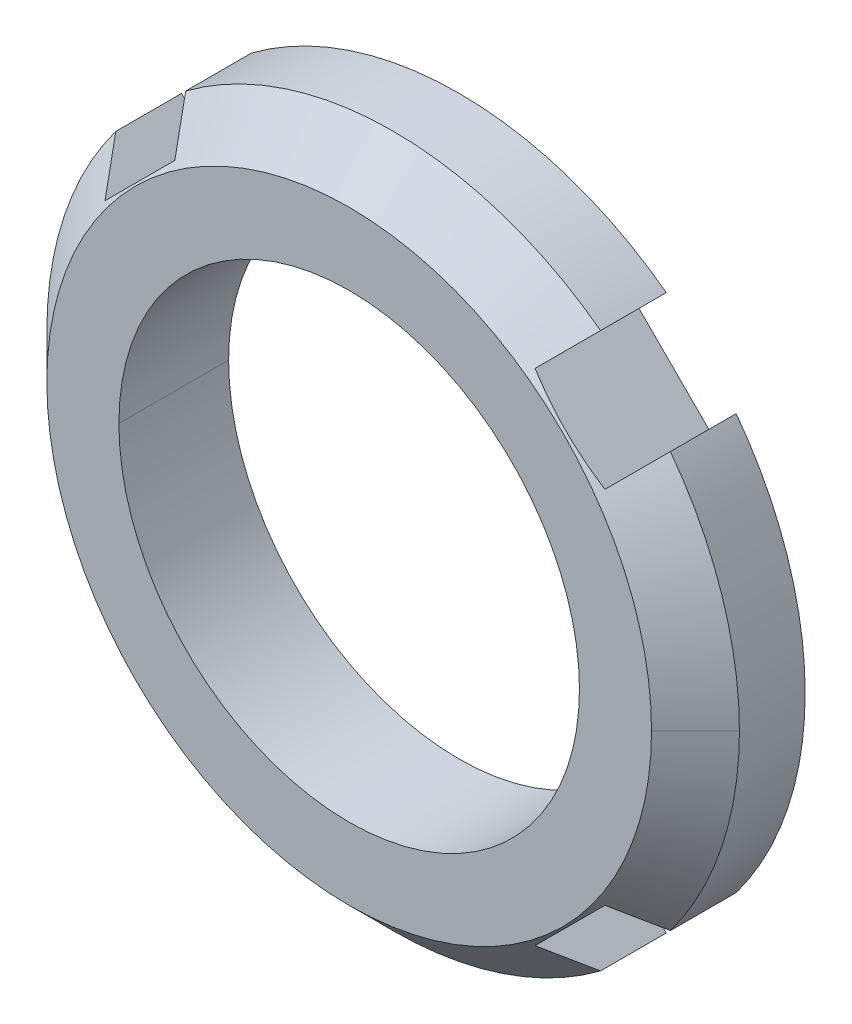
ISO-10303-21;
HEADER;
FILE_DESCRIPTION(('STEP AP214'),'2;1');
FILE_NAME('part.step','',(''),(''),'','','');
FILE_SCHEMA(('AUTOMOTIVE_DESIGN { 1 0 10303 214 1 1 1 1 }'));
ENDSEC;
DATA;
#1=APPLICATION_CONTEXT('core data for automotive mechanical design processes');
#2=APPLICATION_PROTOCOL_DEFINITION('international standard','automotive_design',2000,#1);
#3=PRODUCT_CONTEXT('',#1,'mechanical');
#4=PRODUCT('Part','Part','',(#3));
#5=PRODUCT_RELATED_PRODUCT_CATEGORY('part','',(#4));
#6=PRODUCT_DEFINITION_FORMATION('','',#4);
#7=PRODUCT_DEFINITION_CONTEXT('part definition',#1,'design');
#8=PRODUCT_DEFINITION('design','',#6,#7);
#9=PRODUCT_DEFINITION_SHAPE('','',#8);
#10=(LENGTH_UNIT() NAMED_UNIT(*) SI_UNIT(.MILLI.,.METRE.));
#11=(NAMED_UNIT(*) PLANE_ANGLE_UNIT() SI_UNIT($,.RADIAN.));
#12=(NAMED_UNIT(*) SI_UNIT($,.STERADIAN.) SOLID_ANGLE_UNIT());
#13=UNCERTAINTY_MEASURE_WITH_UNIT(LENGTH_MEASURE(1.E-05),#10,'distance_accuracy_value','');
#14=(GEOMETRIC_REPRESENTATION_CONTEXT(3) GLOBAL_UNCERTAINTY_ASSIGNED_CONTEXT((#13)) GLOBAL_UNIT_ASSIGNED_CONTEXT((#10,
#11,#12)) REPRESENTATION_CONTEXT('',''));
#15=CARTESIAN_POINT('',(0.,0.,0.));
#16=DIRECTION('',(0.,0.,1.));
#17=DIRECTION('',(1.,0.,0.));
#18=AXIS2_PLACEMENT_3D('',#15,#16,#17);
#19=CARTESIAN_POINT('',(0.,0.,4.74979999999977));
#20=DIRECTION('',(0.,0.,-1.));
#21=DIRECTION('',(-1.,0.,0.));
#22=AXIS2_PLACEMENT_3D('',#19,#20,#21);
#23=CONICAL_SURFACE('',#22,25.0189999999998,0.7853981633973);
#24=CARTESIAN_POINT('',(0.,0.,4.7498));
#25=DIRECTION('',(0.,0.,1.));
#26=DIRECTION('',(1.,0.,0.));
#27=AXIS2_PLACEMENT_3D('',#24,#25,#26);
#28=CIRCLE('',#27,25.019);
#29=CARTESIAN_POINT('',(-20.0336595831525,-14.9867556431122,4.7497999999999));
#30=VERTEX_POINT('',#29);
#31=CARTESIAN_POINT('',(-25.0189999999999,0.,4.74979999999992));
#32=VERTEX_POINT('',#31);
#33=EDGE_CURVE('E379',#30,#32,#28,.F.);
#34=ORIENTED_EDGE('',*,*,#33,.F.);
#35=CARTESIAN_POINT('',(-18.0592950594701,-13.0123911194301,7.50985885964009));
#36=CARTESIAN_POINT('',(-18.3885780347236,-13.3416740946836,7.05016696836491));
#37=CARTESIAN_POINT('',(-18.7177499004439,-13.6708459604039,6.59031611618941));
#38=CARTESIAN_POINT('',(-19.3758714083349,-14.3289674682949,5.67029649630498));
#39=CARTESIAN_POINT('',(-19.7048210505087,-14.6579171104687,5.21012772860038));
#40=CARTESIAN_POINT('',(-20.0336595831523,-14.9867556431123,4.7497999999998));
#41=B_SPLINE_CURVE_WITH_KNOTS('',3,(#35,#36,#37,#38,#39,#40),.UNSPECIFIED.,.F.,.F.,(4,2,4),(0.,
1.96304339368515,3.92608676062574),.UNSPECIFIED.);
#42=CARTESIAN_POINT('',(-18.05929505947,-13.01239111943,7.50985885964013));
#43=VERTEX_POINT('',#42);
#44=EDGE_CURVE('E151',#43,#30,#41,.T.);
#45=ORIENTED_EDGE('',*,*,#44,.F.);
#46=CARTESIAN_POINT('',(-13.01239111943,-18.05929505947,7.50985885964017));
#47=CARTESIAN_POINT('',(-13.2215777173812,-17.8501084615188,7.55730968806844));
#48=CARTESIAN_POINT('',(-13.431413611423,-17.640272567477,7.59912125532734));
#49=CARTESIAN_POINT('',(-13.8520969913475,-17.2195891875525,7.67111026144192));
#50=CARTESIAN_POINT('',(-14.062944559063,-17.008741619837,7.70128674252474));
#51=CARTESIAN_POINT('',(-14.4839687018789,-16.5877174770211,7.74948622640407));
#52=CARTESIAN_POINT('',(-14.6941408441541,-16.3775453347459,7.76758630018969));
#53=CARTESIAN_POINT('',(-15.1148230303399,-15.9568631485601,7.79174293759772));
#54=CARTESIAN_POINT('',(-15.325333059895,-15.746353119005,7.79779999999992));
#55=CARTESIAN_POINT('',(-15.746353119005,-15.325333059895,7.79779999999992));
#56=CARTESIAN_POINT('',(-15.9568631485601,-15.1148230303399,7.79174293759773));
#57=CARTESIAN_POINT('',(-16.3775453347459,-14.6941408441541,7.76758630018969));
#58=CARTESIAN_POINT('',(-16.5877174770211,-14.4839687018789,7.74948622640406));
#59=CARTESIAN_POINT('',(-17.008741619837,-14.062944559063,7.70128674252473));
#60=CARTESIAN_POINT('',(-17.2195891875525,-13.8520969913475,7.67111026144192));
#61=CARTESIAN_POINT('',(-17.640272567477,-13.431413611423,7.59912125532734));
#62=CARTESIAN_POINT('',(-17.8501084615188,-13.2215777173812,7.55730968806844));
#63=CARTESIAN_POINT('',(-18.05929505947,-13.01239111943,7.50985885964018));
#64=B_SPLINE_CURVE_WITH_KNOTS('',3,(#46,#47,#48,#49,#50,#51,#52,#53,#54,#55,#56,#57,#58,#59,#60,
#61,#62,#63),.UNSPECIFIED.,.F.,.F.,(4,2,2,2,2,2,2,2,4),(0.,0.898813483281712,1.79770093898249,
2.69079542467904,3.58385292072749,4.47691041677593,5.37000490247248,6.26889235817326,
7.16770584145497),.UNSPECIFIED.);
#65=CARTESIAN_POINT('',(-13.01239111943,-18.05929505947,7.50985885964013));
#66=VERTEX_POINT('',#65);
#67=EDGE_CURVE('E152',#66,#43,#64,.T.);
#68=ORIENTED_EDGE('',*,*,#67,.F.);
#69=CARTESIAN_POINT('',(-14.9867556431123,-20.0336595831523,4.7497999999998));
#70=CARTESIAN_POINT('',(-14.6579171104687,-19.7048210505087,5.21012772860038));
#71=CARTESIAN_POINT('',(-14.3289674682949,-19.3758714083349,5.67029649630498));
#72=CARTESIAN_POINT('',(-13.6708459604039,-18.7177499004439,6.59031611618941));
#73=CARTESIAN_POINT('',(-13.3416740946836,-18.3885780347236,7.05016696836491));
#74=CARTESIAN_POINT('',(-13.0123911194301,-18.0592950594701,7.50985885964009));
#75=B_SPLINE_CURVE_WITH_KNOTS('',3,(#69,#70,#71,#72,#73,#74),.UNSPECIFIED.,.F.,.F.,(4,2,4),(0.,
1.96304336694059,3.92608676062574),.UNSPECIFIED.);
#76=CARTESIAN_POINT('',(-14.9867556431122,-20.0336595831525,4.7497999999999));
#77=VERTEX_POINT('',#76);
#78=EDGE_CURVE('E267',#77,#66,#75,.T.);
#79=ORIENTED_EDGE('',*,*,#78,.F.);
#80=CARTESIAN_POINT('',(0.,0.,4.7498));
#81=DIRECTION('',(0.,0.,1.));
#82=DIRECTION('',(1.,0.,0.));
#83=AXIS2_PLACEMENT_3D('',#80,#81,#82);
#84=CIRCLE('',#83,25.019);
#85=CARTESIAN_POINT('',(14.9867556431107,-20.0336595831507,4.74980000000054));
#86=VERTEX_POINT('',#85);
#87=EDGE_CURVE('E368',#86,#77,#84,.F.);
#88=ORIENTED_EDGE('',*,*,#87,.F.);
#89=CARTESIAN_POINT('',(13.0123911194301,-18.0592950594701,7.50985885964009));
#90=CARTESIAN_POINT('',(13.3416740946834,-18.3885780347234,7.05016696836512));
#91=CARTESIAN_POINT('',(13.6708459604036,-18.7177499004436,6.59031611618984));
#92=CARTESIAN_POINT('',(14.3289674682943,-19.3758714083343,5.67029649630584));
#93=CARTESIAN_POINT('',(14.6579171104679,-19.7048210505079,5.21012772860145));
#94=CARTESIAN_POINT('',(14.9867556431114,-20.0336595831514,4.74980000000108));
#95=B_SPLINE_CURVE_WITH_KNOTS('',3,(#89,#90,#91,#92,#93,#94),.UNSPECIFIED.,.F.,.F.,(4,2,4),(0.,
1.96304339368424,3.92608676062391),.UNSPECIFIED.);
#96=CARTESIAN_POINT('',(13.01239111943,-18.05929505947,7.50985885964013));
#97=VERTEX_POINT('',#96);
#98=EDGE_CURVE('E262',#97,#86,#95,.T.);
#99=ORIENTED_EDGE('',*,*,#98,.F.);
#100=CARTESIAN_POINT('',(18.05929505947,-13.01239111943,7.50985885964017));
#101=CARTESIAN_POINT('',(17.8501084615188,-13.2215777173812,7.55730968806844));
#102=CARTESIAN_POINT('',(17.640272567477,-13.431413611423,7.59912125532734));
#103=CARTESIAN_POINT('',(17.2195891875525,-13.8520969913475,7.67111026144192));
#104=CARTESIAN_POINT('',(17.008741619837,-14.062944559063,7.70128674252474));
#105=CARTESIAN_POINT('',(16.5877174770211,-14.4839687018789,7.74948622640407));
#106=CARTESIAN_POINT('',(16.3775453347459,-14.6941408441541,7.76758630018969));
#107=CARTESIAN_POINT('',(15.9568631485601,-15.1148230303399,7.79174293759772));
#108=CARTESIAN_POINT('',(15.746353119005,-15.325333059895,7.79779999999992));
#109=CARTESIAN_POINT('',(15.325333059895,-15.746353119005,7.79779999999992));
#110=CARTESIAN_POINT('',(15.1148230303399,-15.9568631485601,7.79174293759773));
#111=CARTESIAN_POINT('',(14.6941408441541,-16.3775453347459,7.76758630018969));
#112=CARTESIAN_POINT('',(14.4839687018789,-16.5877174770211,7.74948622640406));
#113=CARTESIAN_POINT('',(14.062944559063,-17.008741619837,7.70128674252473));
#114=CARTESIAN_POINT('',(13.8520969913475,-17.2195891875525,7.67111026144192));
#115=CARTESIAN_POINT('',(13.431413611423,-17.640272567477,7.59912125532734));
#116=CARTESIAN_POINT('',(13.2215777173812,-17.8501084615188,7.55730968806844));
#117=CARTESIAN_POINT('',(13.01239111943,-18.05929505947,7.50985885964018));
#118=B_SPLINE_CURVE_WITH_KNOTS('',3,(#100,#101,#102,#103,#104,#105,#106,#107,#108,#109,#110,
#111,#112,#113,#114,#115,#116,#117),.UNSPECIFIED.,.F.,.F.,(4,2,2,2,2,2,2,2,4),(0.,
0.898813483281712,1.79770093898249,2.69079542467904,3.58385292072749,4.47691041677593,
5.37000490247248,6.26889235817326,7.16770584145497),.UNSPECIFIED.);
#119=CARTESIAN_POINT('',(18.05929505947,-13.01239111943,7.50985885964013));
#120=VERTEX_POINT('',#119);
#121=EDGE_CURVE('E256',#120,#97,#118,.T.);
#122=ORIENTED_EDGE('',*,*,#121,.F.);
#123=CARTESIAN_POINT('',(20.0336595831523,-14.9867556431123,4.7497999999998));
#124=CARTESIAN_POINT('',(19.7048210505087,-14.6579171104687,5.21012772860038));
#125=CARTESIAN_POINT('',(19.3758714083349,-14.3289674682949,5.67029649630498));
#126=CARTESIAN_POINT('',(18.7177499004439,-13.6708459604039,6.59031611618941));
#127=CARTESIAN_POINT('',(18.3885780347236,-13.3416740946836,7.05016696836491));
#128=CARTESIAN_POINT('',(18.0592950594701,-13.0123911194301,7.50985885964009));
#129=B_SPLINE_CURVE_WITH_KNOTS('',3,(#123,#124,#125,#126,#127,#128),.UNSPECIFIED.,.F.,.F.,(4,2,
4),(0.,1.96304336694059,3.92608676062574),.UNSPECIFIED.);
#130=CARTESIAN_POINT('',(20.0336595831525,-14.9867556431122,4.7497999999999));
#131=VERTEX_POINT('',#130);
#132=EDGE_CURVE('E249',#131,#120,#129,.T.);
#133=ORIENTED_EDGE('',*,*,#132,.F.);
#134=CARTESIAN_POINT('',(0.,0.,4.7498));
#135=DIRECTION('',(0.,0.,1.));
#136=DIRECTION('',(1.,0.,0.));
#137=AXIS2_PLACEMENT_3D('',#134,#135,#136);
#138=CIRCLE('',#137,25.019);
#139=CARTESIAN_POINT('',(25.0189999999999,0.,4.74979999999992));
#140=VERTEX_POINT('',#139);
#141=EDGE_CURVE('E147',#140,#131,#138,.F.);
#142=ORIENTED_EDGE('',*,*,#141,.F.);
#143=DIRECTION('',(-0.707106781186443,0.,0.707106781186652));
#144=VECTOR('',#143,1.);
#145=CARTESIAN_POINT('',(23.4315,0.,6.3373));
#146=LINE('',#145,#144);
#147=CARTESIAN_POINT('',(21.8440000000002,0.,7.92480000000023));
#148=VERTEX_POINT('',#147);
#149=EDGE_CURVE('E142',#148,#140,#146,.F.);
#150=ORIENTED_EDGE('',*,*,#149,.F.);
#151=CARTESIAN_POINT('',(0.,0.,7.92480000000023));
#152=DIRECTION('',(0.,0.,-1.));
#153=DIRECTION('',(-1.,0.,0.));
#154=AXIS2_PLACEMENT_3D('',#151,#152,#153);
#155=CIRCLE('',#154,21.8440000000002);
#156=CARTESIAN_POINT('',(-21.8440000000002,0.,7.92480000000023));
#157=VERTEX_POINT('',#156);
#158=EDGE_CURVE('E20',#157,#148,#155,.F.);
#159=ORIENTED_EDGE('',*,*,#158,.F.);
#160=DIRECTION('',(0.707106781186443,0.,0.707106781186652));
#161=VECTOR('',#160,1.);
#162=CARTESIAN_POINT('',(-23.4315,0.,6.3373));
#163=LINE('',#162,#161);
#164=EDGE_CURVE('E133',#32,#157,#163,.T.);
#165=ORIENTED_EDGE('',*,*,#164,.F.);
#166=EDGE_LOOP('',(#34,#45,#68,#79,#88,#99,#122,#133,#142,#150,#159,#165));
#167=FACE_BOUND('',#166,.T.);
#168=ADVANCED_FACE('F16',(#167),#23,.T.);
#169=CARTESIAN_POINT('',(0.,0.,4.74979999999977));
#170=DIRECTION('',(0.,0.,-1.));
#171=DIRECTION('',(-1.,0.,0.));
#172=AXIS2_PLACEMENT_3D('',#169,#170,#171);
#173=CONICAL_SURFACE('',#172,25.0189999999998,0.7853981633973);
#174=CARTESIAN_POINT('',(-13.01239111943,18.05929505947,7.50985885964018));
#175=CARTESIAN_POINT('',(-13.2215777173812,17.8501084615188,7.55730968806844));
#176=CARTESIAN_POINT('',(-13.431413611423,17.640272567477,7.59912125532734));
#177=CARTESIAN_POINT('',(-13.8520969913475,17.2195891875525,7.67111026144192));
#178=CARTESIAN_POINT('',(-14.062944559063,17.008741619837,7.70128674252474));
#179=CARTESIAN_POINT('',(-14.4839687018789,16.5877174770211,7.74948622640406));
#180=CARTESIAN_POINT('',(-14.6941408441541,16.3775453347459,7.76758630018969));
#181=CARTESIAN_POINT('',(-15.1148230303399,15.9568631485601,7.79174293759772));
#182=CARTESIAN_POINT('',(-15.325333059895,15.746353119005,7.79779999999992));
#183=CARTESIAN_POINT('',(-15.746353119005,15.325333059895,7.79779999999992));
#184=CARTESIAN_POINT('',(-15.9568631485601,15.1148230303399,7.79174293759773));
#185=CARTESIAN_POINT('',(-16.3775453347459,14.6941408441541,7.76758630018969));
#186=CARTESIAN_POINT('',(-16.5877174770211,14.4839687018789,7.74948622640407));
#187=CARTESIAN_POINT('',(-17.008741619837,14.062944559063,7.70128674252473));
#188=CARTESIAN_POINT('',(-17.2195891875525,13.8520969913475,7.67111026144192));
#189=CARTESIAN_POINT('',(-17.640272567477,13.431413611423,7.59912125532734));
#190=CARTESIAN_POINT('',(-17.8501084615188,13.2215777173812,7.55730968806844));
#191=CARTESIAN_POINT('',(-18.05929505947,13.01239111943,7.50985885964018));
#192=B_SPLINE_CURVE_WITH_KNOTS('',3,(#174,#175,#176,#177,#178,#179,#180,#181,#182,#183,#184,
#185,#186,#187,#188,#189,#190,#191),.UNSPECIFIED.,.F.,.F.,(4,2,2,2,2,2,2,2,4),(0.,
0.898813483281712,1.79770093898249,2.69079542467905,3.58385292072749,4.47691041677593,
5.37000490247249,6.26889235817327,7.16770584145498),.UNSPECIFIED.);
#193=CARTESIAN_POINT('',(-13.01239111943,18.05929505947,7.50985885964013));
#194=VERTEX_POINT('',#193);
#195=CARTESIAN_POINT('',(-18.05929505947,13.01239111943,7.50985885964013));
#196=VERTEX_POINT('',#195);
#197=EDGE_CURVE('E197',#194,#196,#192,.T.);
#198=ORIENTED_EDGE('',*,*,#197,.T.);
#199=CARTESIAN_POINT('',(-18.0592950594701,13.0123911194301,7.50985885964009));
#200=CARTESIAN_POINT('',(-18.3885780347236,13.3416740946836,7.05016696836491));
#201=CARTESIAN_POINT('',(-18.7177499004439,13.6708459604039,6.59031611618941));
#202=CARTESIAN_POINT('',(-19.3758714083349,14.3289674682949,5.67029649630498));
#203=CARTESIAN_POINT('',(-19.7048210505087,14.6579171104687,5.21012772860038));
#204=CARTESIAN_POINT('',(-20.0336595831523,14.9867556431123,4.7497999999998));
#205=B_SPLINE_CURVE_WITH_KNOTS('',3,(#199,#200,#201,#202,#203,#204),.UNSPECIFIED.,.F.,.F.,(4,2,
4),(0.,1.96304339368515,3.92608676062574),.UNSPECIFIED.);
#206=CARTESIAN_POINT('',(-20.0336595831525,14.9867556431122,4.7497999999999));
#207=VERTEX_POINT('',#206);
#208=EDGE_CURVE('E189',#196,#207,#205,.T.);
#209=ORIENTED_EDGE('',*,*,#208,.T.);
#210=CARTESIAN_POINT('',(0.,0.,4.7498));
#211=DIRECTION('',(0.,0.,1.));
#212=DIRECTION('',(1.,0.,0.));
#213=AXIS2_PLACEMENT_3D('',#210,#211,#212);
#214=CIRCLE('',#213,25.019);
#215=EDGE_CURVE('E382',#32,#207,#214,.F.);
#216=ORIENTED_EDGE('',*,*,#215,.F.);
#217=ORIENTED_EDGE('',*,*,#164,.T.);
#218=CARTESIAN_POINT('',(0.,0.,7.92480000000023));
#219=DIRECTION('',(0.,0.,-1.));
#220=DIRECTION('',(-1.,0.,0.));
#221=AXIS2_PLACEMENT_3D('',#218,#219,#220);
#222=CIRCLE('',#221,21.8440000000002);
#223=EDGE_CURVE('E140',#148,#157,#222,.F.);
#224=ORIENTED_EDGE('',*,*,#223,.F.);
#225=ORIENTED_EDGE('',*,*,#149,.T.);
#226=CARTESIAN_POINT('',(0.,0.,4.7498));
#227=DIRECTION('',(0.,0.,1.));
#228=DIRECTION('',(1.,0.,0.));
#229=AXIS2_PLACEMENT_3D('',#226,#227,#228);
#230=CIRCLE('',#229,25.019);
#231=CARTESIAN_POINT('',(20.0336595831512,14.9867556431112,4.7498));
#232=VERTEX_POINT('',#231);
#233=EDGE_CURVE('E358',#232,#140,#230,.F.);
#234=ORIENTED_EDGE('',*,*,#233,.F.);
#235=CARTESIAN_POINT('',(20.0336595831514,14.9867556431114,4.74980000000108));
#236=CARTESIAN_POINT('',(19.7048210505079,14.6579171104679,5.21012772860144));
#237=CARTESIAN_POINT('',(19.3758714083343,14.3289674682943,5.67029649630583));
#238=CARTESIAN_POINT('',(18.7177499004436,13.6708459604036,6.59031611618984));
#239=CARTESIAN_POINT('',(18.3885780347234,13.3416740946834,7.05016696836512));
#240=CARTESIAN_POINT('',(18.0592950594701,13.0123911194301,7.50985885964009));
#241=B_SPLINE_CURVE_WITH_KNOTS('',3,(#235,#236,#237,#238,#239,#240),.UNSPECIFIED.,.F.,.F.,(4,2,
4),(0.,1.96304336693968,3.92608676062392),.UNSPECIFIED.);
#242=CARTESIAN_POINT('',(18.05929505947,13.01239111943,7.50985885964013));
#243=VERTEX_POINT('',#242);
#244=EDGE_CURVE('E179',#232,#243,#241,.T.);
#245=ORIENTED_EDGE('',*,*,#244,.T.);
#246=CARTESIAN_POINT('',(18.05929505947,13.01239111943,7.50985885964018));
#247=CARTESIAN_POINT('',(17.8501084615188,13.2215777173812,7.55730968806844));
#248=CARTESIAN_POINT('',(17.640272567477,13.431413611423,7.59912125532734));
#249=CARTESIAN_POINT('',(17.2195891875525,13.8520969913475,7.67111026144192));
#250=CARTESIAN_POINT('',(17.008741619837,14.062944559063,7.70128674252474));
#251=CARTESIAN_POINT('',(16.5877174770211,14.4839687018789,7.74948622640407));
#252=CARTESIAN_POINT('',(16.3775453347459,14.6941408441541,7.76758630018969));
#253=CARTESIAN_POINT('',(15.9568631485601,15.1148230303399,7.79174293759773));
#254=CARTESIAN_POINT('',(15.746353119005,15.325333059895,7.79779999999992));
#255=CARTESIAN_POINT('',(15.325333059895,15.746353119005,7.79779999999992));
#256=CARTESIAN_POINT('',(15.1148230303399,15.9568631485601,7.79174293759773));
#257=CARTESIAN_POINT('',(14.6941408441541,16.3775453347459,7.76758630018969));
#258=CARTESIAN_POINT('',(14.4839687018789,16.5877174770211,7.74948622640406));
#259=CARTESIAN_POINT('',(14.062944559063,17.008741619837,7.70128674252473));
#260=CARTESIAN_POINT('',(13.8520969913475,17.2195891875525,7.67111026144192));
#261=CARTESIAN_POINT('',(13.431413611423,17.640272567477,7.59912125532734));
#262=CARTESIAN_POINT('',(13.2215777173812,17.8501084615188,7.55730968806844));
#263=CARTESIAN_POINT('',(13.01239111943,18.05929505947,7.50985885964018));
#264=B_SPLINE_CURVE_WITH_KNOTS('',3,(#246,#247,#248,#249,#250,#251,#252,#253,#254,#255,#256,
#257,#258,#259,#260,#261,#262,#263),.UNSPECIFIED.,.F.,.F.,(4,2,2,2,2,2,2,2,4),(0.,
0.898813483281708,1.79770093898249,2.69079542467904,3.58385292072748,4.47691041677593,
5.37000490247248,6.26889235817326,7.16770584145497),.UNSPECIFIED.);
#265=CARTESIAN_POINT('',(13.01239111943,18.05929505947,7.50985885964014));
#266=VERTEX_POINT('',#265);
#267=EDGE_CURVE('E217',#243,#266,#264,.T.);
#268=ORIENTED_EDGE('',*,*,#267,.T.);
#269=CARTESIAN_POINT('',(13.0123911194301,18.0592950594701,7.50985885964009));
#270=CARTESIAN_POINT('',(13.3416740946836,18.3885780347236,7.05016696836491));
#271=CARTESIAN_POINT('',(13.6708459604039,18.7177499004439,6.59031611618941));
#272=CARTESIAN_POINT('',(14.3289674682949,19.3758714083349,5.67029649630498));
#273=CARTESIAN_POINT('',(14.6579171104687,19.7048210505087,5.21012772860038));
#274=CARTESIAN_POINT('',(14.9867556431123,20.0336595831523,4.7497999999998));
#275=B_SPLINE_CURVE_WITH_KNOTS('',3,(#269,#270,#271,#272,#273,#274),.UNSPECIFIED.,.F.,.F.,(4,2,
4),(0.,1.96304339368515,3.92608676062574),.UNSPECIFIED.);
#276=CARTESIAN_POINT('',(14.9867556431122,20.0336595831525,4.7497999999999));
#277=VERTEX_POINT('',#276);
#278=EDGE_CURVE('E209',#266,#277,#275,.T.);
#279=ORIENTED_EDGE('',*,*,#278,.T.);
#280=CARTESIAN_POINT('',(0.,0.,4.7498));
#281=DIRECTION('',(0.,0.,1.));
#282=DIRECTION('',(1.,0.,0.));
#283=AXIS2_PLACEMENT_3D('',#280,#281,#282);
#284=CIRCLE('',#283,25.019);
#285=CARTESIAN_POINT('',(-14.9867556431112,20.0336595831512,4.7498));
#286=VERTEX_POINT('',#285);
#287=EDGE_CURVE('E215',#286,#277,#284,.F.);
#288=ORIENTED_EDGE('',*,*,#287,.F.);
#289=CARTESIAN_POINT('',(-14.9867556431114,20.0336595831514,4.74980000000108));
#290=CARTESIAN_POINT('',(-14.6579171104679,19.7048210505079,5.21012772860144));
#291=CARTESIAN_POINT('',(-14.3289674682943,19.3758714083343,5.67029649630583));
#292=CARTESIAN_POINT('',(-13.6708459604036,18.7177499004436,6.59031611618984));
#293=CARTESIAN_POINT('',(-13.3416740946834,18.3885780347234,7.05016696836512));
#294=CARTESIAN_POINT('',(-13.0123911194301,18.0592950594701,7.50985885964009));
#295=B_SPLINE_CURVE_WITH_KNOTS('',3,(#289,#290,#291,#292,#293,#294),.UNSPECIFIED.,.F.,.F.,(4,2,
4),(0.,1.96304336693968,3.92608676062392),.UNSPECIFIED.);
#296=EDGE_CURVE('E203',#286,#194,#295,.T.);
#297=ORIENTED_EDGE('',*,*,#296,.T.);
#298=EDGE_LOOP('',(#198,#209,#216,#217,#224,#225,#234,#245,#268,#279,#288,#297));
#299=FACE_BOUND('',#298,.T.);
#300=ADVANCED_FACE('F150',(#299),#173,.T.);
#301=CARTESIAN_POINT('',(0.,0.,7.9248));
#302=DIRECTION('',(0.,0.,1.));
#303=DIRECTION('',(1.,0.,0.));
#304=AXIS2_PLACEMENT_3D('',#301,#302,#303);
#305=PLANE('',#304);
#306=CARTESIAN_POINT('',(0.,0.,7.9248));
#307=DIRECTION('',(0.,0.,-1.));
#308=DIRECTION('',(-1.,0.,0.));
#309=AXIS2_PLACEMENT_3D('',#306,#307,#308);
#310=CIRCLE('',#309,16.637);
#311=CARTESIAN_POINT('',(16.637,0.,7.9248));
#312=VERTEX_POINT('',#311);
#313=CARTESIAN_POINT('',(-16.637,0.,7.9248));
#314=VERTEX_POINT('',#313);
#315=EDGE_CURVE('E404',#312,#314,#310,.T.);
#316=ORIENTED_EDGE('',*,*,#315,.T.);
#317=CARTESIAN_POINT('',(0.,0.,7.9248));
#318=DIRECTION('',(0.,0.,-1.));
#319=DIRECTION('',(-1.,0.,0.));
#320=AXIS2_PLACEMENT_3D('',#317,#318,#319);
#321=CIRCLE('',#320,16.637);
#322=EDGE_CURVE('E407',#314,#312,#321,.T.);
#323=ORIENTED_EDGE('',*,*,#322,.T.);
#324=EDGE_LOOP('',(#316,#323));
#325=FACE_BOUND('',#324,.T.);
#326=ORIENTED_EDGE('',*,*,#158,.T.);
#327=ORIENTED_EDGE('',*,*,#223,.T.);
#328=EDGE_LOOP('',(#326,#327));
#329=FACE_BOUND('',#328,.T.);
#330=ADVANCED_FACE('F139',(#325,#329),#305,.T.);
#331=CARTESIAN_POINT('',(-23.10619899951,-18.05929505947,7.9248));
#332=DIRECTION('',(0.707106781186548,-0.707106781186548,0.));
#333=DIRECTION('',(0.707106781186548,0.707106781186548,0.));
#334=AXIS2_PLACEMENT_3D('',#331,#332,#333);
#335=PLANE('',#334);
#336=DIRECTION('',(0.,0.,1.));
#337=VECTOR('',#336,1.);
#338=CARTESIAN_POINT('',(-20.0336595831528,-14.9867556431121,0.));
#339=LINE('',#338,#337);
#340=CARTESIAN_POINT('',(-20.0336595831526,-14.9867556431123,0.));
#341=VERTEX_POINT('',#340);
#342=EDGE_CURVE('E408',#341,#30,#339,.T.);
#343=ORIENTED_EDGE('',*,*,#342,.F.);
#344=DIRECTION('',(0.707106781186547,0.707106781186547,0.));
#345=VECTOR('',#344,1.);
#346=CARTESIAN_POINT('',(-20.03365958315,-14.98675564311,0.));
#347=LINE('',#346,#345);
#348=CARTESIAN_POINT('',(-18.05929505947,-13.01239111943,0.));
#349=VERTEX_POINT('',#348);
#350=EDGE_CURVE('E375',#341,#349,#347,.T.);
#351=ORIENTED_EDGE('',*,*,#350,.T.);
#352=DIRECTION('',(0.,0.,1.));
#353=VECTOR('',#352,1.);
#354=CARTESIAN_POINT('',(-18.05929505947,-13.01239111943,7.9248));
#355=LINE('',#354,#353);
#356=EDGE_CURVE('E376',#43,#349,#355,.F.);
#357=ORIENTED_EDGE('',*,*,#356,.F.);
#358=ORIENTED_EDGE('',*,*,#44,.T.);
#359=EDGE_LOOP('',(#343,#351,#357,#358));
#360=FACE_BOUND('',#359,.T.);
#361=ADVANCED_FACE('F164',(#360),#335,.T.);
#362=CARTESIAN_POINT('',(-18.05929505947,-13.01239111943,7.9248));
#363=DIRECTION('',(-0.707106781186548,-0.707106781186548,0.));
#364=DIRECTION('',(0.707106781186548,-0.707106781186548,0.));
#365=AXIS2_PLACEMENT_3D('',#362,#363,#364);
#366=PLANE('',#365);
#367=ORIENTED_EDGE('',*,*,#356,.T.);
#368=DIRECTION('',(0.707106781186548,-0.707106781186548,0.));
#369=VECTOR('',#368,1.);
#370=CARTESIAN_POINT('',(-18.05929505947,-13.01239111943,0.));
#371=LINE('',#370,#369);
#372=CARTESIAN_POINT('',(-13.01239111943,-18.05929505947,0.));
#373=VERTEX_POINT('',#372);
#374=EDGE_CURVE('E371',#349,#373,#371,.T.);
#375=ORIENTED_EDGE('',*,*,#374,.T.);
#376=DIRECTION('',(0.,0.,1.));
#377=VECTOR('',#376,1.);
#378=CARTESIAN_POINT('',(-13.01239111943,-18.05929505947,7.9248));
#379=LINE('',#378,#377);
#380=EDGE_CURVE('E369',#66,#373,#379,.F.);
#381=ORIENTED_EDGE('',*,*,#380,.F.);
#382=ORIENTED_EDGE('',*,*,#67,.T.);
#383=EDGE_LOOP('',(#367,#375,#381,#382));
#384=FACE_BOUND('',#383,.T.);
#385=ADVANCED_FACE('F168',(#384),#366,.T.);
#386=CARTESIAN_POINT('',(-13.01239111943,-18.05929505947,7.9248));
#387=DIRECTION('',(-0.707106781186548,0.707106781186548,0.));
#388=DIRECTION('',(-0.707106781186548,-0.707106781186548,0.));
#389=AXIS2_PLACEMENT_3D('',#386,#387,#388);
#390=PLANE('',#389);
#391=ORIENTED_EDGE('',*,*,#380,.T.);
#392=DIRECTION('',(-0.707106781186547,-0.707106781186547,0.));
#393=VECTOR('',#392,1.);
#394=CARTESIAN_POINT('',(-13.01239111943,-18.05929505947,0.));
#395=LINE('',#394,#393);
#396=CARTESIAN_POINT('',(-14.9867556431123,-20.0336595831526,0.));
#397=VERTEX_POINT('',#396);
#398=EDGE_CURVE('E374',#373,#397,#395,.T.);
#399=ORIENTED_EDGE('',*,*,#398,.T.);
#400=DIRECTION('',(0.,0.,1.));
#401=VECTOR('',#400,1.);
#402=CARTESIAN_POINT('',(-14.9867556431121,-20.0336595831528,0.));
#403=LINE('',#402,#401);
#404=EDGE_CURVE('E266',#77,#397,#403,.F.);
#405=ORIENTED_EDGE('',*,*,#404,.F.);
#406=ORIENTED_EDGE('',*,*,#78,.T.);
#407=EDGE_LOOP('',(#391,#399,#405,#406));
#408=FACE_BOUND('',#407,.T.);
#409=ADVANCED_FACE('F278',(#408),#390,.T.);
#410=CARTESIAN_POINT('',(0.,0.,0.));
#411=DIRECTION('',(0.,0.,1.));
#412=DIRECTION('',(1.,0.,0.));
#413=AXIS2_PLACEMENT_3D('',#410,#411,#412);
#414=CYLINDRICAL_SURFACE('',#413,25.019);
#415=ORIENTED_EDGE('',*,*,#87,.T.);
#416=ORIENTED_EDGE('',*,*,#404,.T.);
#417=CARTESIAN_POINT('',(0.,0.,0.));
#418=DIRECTION('',(0.,0.,1.));
#419=DIRECTION('',(1.,0.,0.));
#420=AXIS2_PLACEMENT_3D('',#417,#418,#419);
#421=CIRCLE('',#420,25.019);
#422=CARTESIAN_POINT('',(14.9867556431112,-20.0336595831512,0.));
#423=VERTEX_POINT('',#422);
#424=EDGE_CURVE('E401',#397,#423,#421,.T.);
#425=ORIENTED_EDGE('',*,*,#424,.T.);
#426=DIRECTION('',(0.,0.,1.));
#427=VECTOR('',#426,1.);
#428=CARTESIAN_POINT('',(14.98675564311,-20.03365958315,7.9248));
#429=LINE('',#428,#427);
#430=EDGE_CURVE('E261',#86,#423,#429,.F.);
#431=ORIENTED_EDGE('',*,*,#430,.F.);
#432=EDGE_LOOP('',(#415,#416,#425,#431));
#433=FACE_BOUND('',#432,.T.);
#434=ADVANCED_FACE('F275',(#433),#414,.T.);
#435=CARTESIAN_POINT('',(18.05929505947,-23.10619899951,7.9248));
#436=DIRECTION('',(0.707106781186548,0.707106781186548,0.));
#437=DIRECTION('',(-0.707106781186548,0.707106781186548,0.));
#438=AXIS2_PLACEMENT_3D('',#435,#436,#437);
#439=PLANE('',#438);
#440=ORIENTED_EDGE('',*,*,#430,.T.);
#441=DIRECTION('',(-0.707106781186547,0.707106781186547,0.));
#442=VECTOR('',#441,1.);
#443=CARTESIAN_POINT('',(14.98675564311,-20.03365958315,0.));
#444=LINE('',#443,#442);
#445=CARTESIAN_POINT('',(13.01239111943,-18.05929505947,0.));
#446=VERTEX_POINT('',#445);
#447=EDGE_CURVE('E363',#423,#446,#444,.T.);
#448=ORIENTED_EDGE('',*,*,#447,.T.);
#449=DIRECTION('',(0.,0.,1.));
#450=VECTOR('',#449,1.);
#451=CARTESIAN_POINT('',(13.01239111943,-18.05929505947,7.9248));
#452=LINE('',#451,#450);
#453=EDGE_CURVE('E255',#97,#446,#452,.F.);
#454=ORIENTED_EDGE('',*,*,#453,.F.);
#455=ORIENTED_EDGE('',*,*,#98,.T.);
#456=EDGE_LOOP('',(#440,#448,#454,#455));
#457=FACE_BOUND('',#456,.T.);
#458=ADVANCED_FACE('F271',(#457),#439,.T.);
#459=CARTESIAN_POINT('',(13.01239111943,-18.05929505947,7.9248));
#460=DIRECTION('',(0.707106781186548,-0.707106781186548,0.));
#461=DIRECTION('',(0.707106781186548,0.707106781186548,0.));
#462=AXIS2_PLACEMENT_3D('',#459,#460,#461);
#463=PLANE('',#462);
#464=ORIENTED_EDGE('',*,*,#453,.T.);
#465=DIRECTION('',(0.707106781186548,0.707106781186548,0.));
#466=VECTOR('',#465,1.);
#467=CARTESIAN_POINT('',(13.01239111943,-18.05929505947,0.));
#468=LINE('',#467,#466);
#469=CARTESIAN_POINT('',(18.05929505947,-13.01239111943,0.));
#470=VERTEX_POINT('',#469);
#471=EDGE_CURVE('E359',#446,#470,#468,.T.);
#472=ORIENTED_EDGE('',*,*,#471,.T.);
#473=DIRECTION('',(0.,0.,1.));
#474=VECTOR('',#473,1.);
#475=CARTESIAN_POINT('',(18.05929505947,-13.01239111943,7.9248));
#476=LINE('',#475,#474);
#477=EDGE_CURVE('E254',#120,#470,#476,.F.);
#478=ORIENTED_EDGE('',*,*,#477,.F.);
#479=ORIENTED_EDGE('',*,*,#121,.T.);
#480=EDGE_LOOP('',(#464,#472,#478,#479));
#481=FACE_BOUND('',#480,.T.);
#482=ADVANCED_FACE('F245',(#481),#463,.T.);
#483=CARTESIAN_POINT('',(18.05929505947,-13.01239111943,7.9248));
#484=DIRECTION('',(-0.707106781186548,-0.707106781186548,0.));
#485=DIRECTION('',(0.707106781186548,-0.707106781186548,0.));
#486=AXIS2_PLACEMENT_3D('',#483,#484,#485);
#487=PLANE('',#486);
#488=ORIENTED_EDGE('',*,*,#477,.T.);
#489=DIRECTION('',(0.707106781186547,-0.707106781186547,0.));
#490=VECTOR('',#489,1.);
#491=CARTESIAN_POINT('',(18.05929505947,-13.01239111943,0.));
#492=LINE('',#491,#490);
#493=CARTESIAN_POINT('',(20.0336595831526,-14.9867556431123,0.));
#494=VERTEX_POINT('',#493);
#495=EDGE_CURVE('E362',#470,#494,#492,.T.);
#496=ORIENTED_EDGE('',*,*,#495,.T.);
#497=DIRECTION('',(0.,0.,1.));
#498=VECTOR('',#497,1.);
#499=CARTESIAN_POINT('',(20.0336595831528,-14.9867556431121,0.));
#500=LINE('',#499,#498);
#501=EDGE_CURVE('E354',#131,#494,#500,.F.);
#502=ORIENTED_EDGE('',*,*,#501,.F.);
#503=ORIENTED_EDGE('',*,*,#132,.T.);
#504=EDGE_LOOP('',(#488,#496,#502,#503));
#505=FACE_BOUND('',#504,.T.);
#506=ADVANCED_FACE('F240',(#505),#487,.T.);
#507=CARTESIAN_POINT('',(0.,0.,0.));
#508=DIRECTION('',(0.,0.,1.));
#509=DIRECTION('',(1.,0.,0.));
#510=AXIS2_PLACEMENT_3D('',#507,#508,#509);
#511=CYLINDRICAL_SURFACE('',#510,25.019);
#512=ORIENTED_EDGE('',*,*,#141,.T.);
#513=ORIENTED_EDGE('',*,*,#501,.T.);
#514=CARTESIAN_POINT('',(0.,0.,0.));
#515=DIRECTION('',(0.,0.,1.));
#516=DIRECTION('',(1.,0.,0.));
#517=AXIS2_PLACEMENT_3D('',#514,#515,#516);
#518=CIRCLE('',#517,25.019);
#519=CARTESIAN_POINT('',(20.0336595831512,14.9867556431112,0.));
#520=VERTEX_POINT('',#519);
#521=EDGE_CURVE('E398',#494,#520,#518,.T.);
#522=ORIENTED_EDGE('',*,*,#521,.T.);
#523=DIRECTION('',(0.,0.,1.));
#524=VECTOR('',#523,1.);
#525=CARTESIAN_POINT('',(20.03365958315,14.98675564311,7.9248));
#526=LINE('',#525,#524);
#527=EDGE_CURVE('E351',#520,#232,#526,.T.);
#528=ORIENTED_EDGE('',*,*,#527,.T.);
#529=ORIENTED_EDGE('',*,*,#233,.T.);
#530=EDGE_LOOP('',(#512,#513,#522,#528,#529));
#531=FACE_BOUND('',#530,.T.);
#532=ADVANCED_FACE('F236',(#531),#511,.T.);
#533=CARTESIAN_POINT('',(18.05929505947,13.01239111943,7.9248));
#534=DIRECTION('',(0.707106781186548,-0.707106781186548,0.));
#535=DIRECTION('',(0.707106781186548,0.707106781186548,0.));
#536=AXIS2_PLACEMENT_3D('',#533,#534,#535);
#537=PLANE('',#536);
#538=ORIENTED_EDGE('',*,*,#244,.F.);
#539=ORIENTED_EDGE('',*,*,#527,.F.);
#540=DIRECTION('',(-0.707106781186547,-0.707106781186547,0.));
#541=VECTOR('',#540,1.);
#542=CARTESIAN_POINT('',(20.03365958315,14.98675564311,0.));
#543=LINE('',#542,#541);
#544=CARTESIAN_POINT('',(18.05929505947,13.01239111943,0.));
#545=VERTEX_POINT('',#544);
#546=EDGE_CURVE('E347',#520,#545,#543,.T.);
#547=ORIENTED_EDGE('',*,*,#546,.T.);
#548=DIRECTION('',(0.,0.,1.));
#549=VECTOR('',#548,1.);
#550=CARTESIAN_POINT('',(18.05929505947,13.01239111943,7.9248));
#551=LINE('',#550,#549);
#552=EDGE_CURVE('E348',#545,#243,#551,.T.);
#553=ORIENTED_EDGE('',*,*,#552,.T.);
#554=EDGE_LOOP('',(#538,#539,#547,#553));
#555=FACE_BOUND('',#554,.T.);
#556=ADVANCED_FACE('F231',(#555),#537,.F.);
#557=CARTESIAN_POINT('',(13.01239111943,18.05929505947,7.9248));
#558=DIRECTION('',(-0.707106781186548,-0.707106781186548,0.));
#559=DIRECTION('',(0.707106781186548,-0.707106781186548,0.));
#560=AXIS2_PLACEMENT_3D('',#557,#558,#559);
#561=PLANE('',#560);
#562=ORIENTED_EDGE('',*,*,#267,.F.);
#563=ORIENTED_EDGE('',*,*,#552,.F.);
#564=DIRECTION('',(-0.707106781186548,0.707106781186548,0.));
#565=VECTOR('',#564,1.);
#566=CARTESIAN_POINT('',(18.05929505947,13.01239111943,0.));
#567=LINE('',#566,#565);
#568=CARTESIAN_POINT('',(13.01239111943,18.05929505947,0.));
#569=VERTEX_POINT('',#568);
#570=EDGE_CURVE('E343',#545,#569,#567,.T.);
#571=ORIENTED_EDGE('',*,*,#570,.T.);
#572=DIRECTION('',(0.,0.,1.));
#573=VECTOR('',#572,1.);
#574=CARTESIAN_POINT('',(13.01239111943,18.05929505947,7.9248));
#575=LINE('',#574,#573);
#576=EDGE_CURVE('E216',#569,#266,#575,.T.);
#577=ORIENTED_EDGE('',*,*,#576,.T.);
#578=EDGE_LOOP('',(#562,#563,#571,#577));
#579=FACE_BOUND('',#578,.T.);
#580=ADVANCED_FACE('F227',(#579),#561,.F.);
#581=CARTESIAN_POINT('',(18.05929505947,23.10619899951,7.9248));
#582=DIRECTION('',(-0.707106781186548,0.707106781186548,0.));
#583=DIRECTION('',(-0.707106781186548,-0.707106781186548,0.));
#584=AXIS2_PLACEMENT_3D('',#581,#582,#583);
#585=PLANE('',#584);
#586=ORIENTED_EDGE('',*,*,#278,.F.);
#587=ORIENTED_EDGE('',*,*,#576,.F.);
#588=DIRECTION('',(0.707106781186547,0.707106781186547,0.));
#589=VECTOR('',#588,1.);
#590=CARTESIAN_POINT('',(13.01239111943,18.05929505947,0.));
#591=LINE('',#590,#589);
#592=CARTESIAN_POINT('',(14.9867556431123,20.0336595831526,0.));
#593=VERTEX_POINT('',#592);
#594=EDGE_CURVE('E346',#569,#593,#591,.T.);
#595=ORIENTED_EDGE('',*,*,#594,.T.);
#596=DIRECTION('',(0.,0.,1.));
#597=VECTOR('',#596,1.);
#598=CARTESIAN_POINT('',(14.9867556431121,20.0336595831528,0.));
#599=LINE('',#598,#597);
#600=EDGE_CURVE('E335',#277,#593,#599,.F.);
#601=ORIENTED_EDGE('',*,*,#600,.F.);
#602=EDGE_LOOP('',(#586,#587,#595,#601));
#603=FACE_BOUND('',#602,.T.);
#604=ADVANCED_FACE('F222',(#603),#585,.F.);
#605=CARTESIAN_POINT('',(0.,0.,0.));
#606=DIRECTION('',(0.,0.,1.));
#607=DIRECTION('',(1.,0.,0.));
#608=AXIS2_PLACEMENT_3D('',#605,#606,#607);
#609=CYLINDRICAL_SURFACE('',#608,25.019);
#610=CARTESIAN_POINT('',(0.,0.,0.));
#611=DIRECTION('',(0.,0.,1.));
#612=DIRECTION('',(1.,0.,0.));
#613=AXIS2_PLACEMENT_3D('',#610,#611,#612);
#614=CIRCLE('',#613,25.019);
#615=CARTESIAN_POINT('',(-14.9867556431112,20.0336595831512,0.));
#616=VERTEX_POINT('',#615);
#617=EDGE_CURVE('E334',#593,#616,#614,.T.);
#618=ORIENTED_EDGE('',*,*,#617,.T.);
#619=DIRECTION('',(0.,0.,1.));
#620=VECTOR('',#619,1.);
#621=CARTESIAN_POINT('',(-14.98675564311,20.03365958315,7.9248));
#622=LINE('',#621,#620);
#623=EDGE_CURVE('E327',#616,#286,#622,.T.);
#624=ORIENTED_EDGE('',*,*,#623,.T.);
#625=ORIENTED_EDGE('',*,*,#287,.T.);
#626=ORIENTED_EDGE('',*,*,#600,.T.);
#627=EDGE_LOOP('',(#618,#624,#625,#626));
#628=FACE_BOUND('',#627,.T.);
#629=ADVANCED_FACE('F226',(#628),#609,.T.);
#630=CARTESIAN_POINT('',(-13.01239111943,18.05929505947,7.9248));
#631=DIRECTION('',(0.707106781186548,0.707106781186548,0.));
#632=DIRECTION('',(-0.707106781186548,0.707106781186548,0.));
#633=AXIS2_PLACEMENT_3D('',#630,#631,#632);
#634=PLANE('',#633);
#635=ORIENTED_EDGE('',*,*,#296,.F.);
#636=ORIENTED_EDGE('',*,*,#623,.F.);
#637=DIRECTION('',(0.707106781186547,-0.707106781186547,0.));
#638=VECTOR('',#637,1.);
#639=CARTESIAN_POINT('',(-14.98675564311,20.03365958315,0.));
#640=LINE('',#639,#638);
#641=CARTESIAN_POINT('',(-13.01239111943,18.05929505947,0.));
#642=VERTEX_POINT('',#641);
#643=EDGE_CURVE('E397',#616,#642,#640,.T.);
#644=ORIENTED_EDGE('',*,*,#643,.T.);
#645=DIRECTION('',(0.,0.,1.));
#646=VECTOR('',#645,1.);
#647=CARTESIAN_POINT('',(-13.01239111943,18.05929505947,7.9248));
#648=LINE('',#647,#646);
#649=EDGE_CURVE('E330',#642,#194,#648,.T.);
#650=ORIENTED_EDGE('',*,*,#649,.T.);
#651=EDGE_LOOP('',(#635,#636,#644,#650));
#652=FACE_BOUND('',#651,.T.);
#653=ADVANCED_FACE('F314',(#652),#634,.F.);
#654=CARTESIAN_POINT('',(-18.05929505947,13.01239111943,7.9248));
#655=DIRECTION('',(0.707106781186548,-0.707106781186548,0.));
#656=DIRECTION('',(0.707106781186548,0.707106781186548,0.));
#657=AXIS2_PLACEMENT_3D('',#654,#655,#656);
#658=PLANE('',#657);
#659=ORIENTED_EDGE('',*,*,#197,.F.);
#660=ORIENTED_EDGE('',*,*,#649,.F.);
#661=DIRECTION('',(-0.707106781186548,-0.707106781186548,0.));
#662=VECTOR('',#661,1.);
#663=CARTESIAN_POINT('',(-13.01239111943,18.05929505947,0.));
#664=LINE('',#663,#662);
#665=CARTESIAN_POINT('',(-18.05929505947,13.01239111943,0.));
#666=VERTEX_POINT('',#665);
#667=EDGE_CURVE('E417',#642,#666,#664,.T.);
#668=ORIENTED_EDGE('',*,*,#667,.T.);
#669=DIRECTION('',(0.,0.,1.));
#670=VECTOR('',#669,1.);
#671=CARTESIAN_POINT('',(-18.05929505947,13.01239111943,7.9248));
#672=LINE('',#671,#670);
#673=EDGE_CURVE('E415',#666,#196,#672,.T.);
#674=ORIENTED_EDGE('',*,*,#673,.T.);
#675=EDGE_LOOP('',(#659,#660,#668,#674));
#676=FACE_BOUND('',#675,.T.);
#677=ADVANCED_FACE('F310',(#676),#658,.F.);
#678=CARTESIAN_POINT('',(-23.10619899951,18.05929505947,7.9248));
#679=DIRECTION('',(-0.707106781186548,-0.707106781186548,0.));
#680=DIRECTION('',(0.707106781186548,-0.707106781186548,0.));
#681=AXIS2_PLACEMENT_3D('',#678,#679,#680);
#682=PLANE('',#681);
#683=ORIENTED_EDGE('',*,*,#208,.F.);
#684=ORIENTED_EDGE('',*,*,#673,.F.);
#685=DIRECTION('',(-0.707106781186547,0.707106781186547,0.));
#686=VECTOR('',#685,1.);
#687=CARTESIAN_POINT('',(-18.05929505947,13.01239111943,0.));
#688=LINE('',#687,#686);
#689=CARTESIAN_POINT('',(-20.0336595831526,14.9867556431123,0.));
#690=VERTEX_POINT('',#689);
#691=EDGE_CURVE('E395',#666,#690,#688,.T.);
#692=ORIENTED_EDGE('',*,*,#691,.T.);
#693=DIRECTION('',(0.,0.,1.));
#694=VECTOR('',#693,1.);
#695=CARTESIAN_POINT('',(-20.0336595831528,14.9867556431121,0.));
#696=LINE('',#695,#694);
#697=EDGE_CURVE('E384',#207,#690,#696,.F.);
#698=ORIENTED_EDGE('',*,*,#697,.F.);
#699=EDGE_LOOP('',(#683,#684,#692,#698));
#700=FACE_BOUND('',#699,.T.);
#701=ADVANCED_FACE('F306',(#700),#682,.F.);
#702=CARTESIAN_POINT('',(0.,0.,0.));
#703=DIRECTION('',(0.,0.,1.));
#704=DIRECTION('',(1.,0.,0.));
#705=AXIS2_PLACEMENT_3D('',#702,#703,#704);
#706=CYLINDRICAL_SURFACE('',#705,25.019);
#707=CARTESIAN_POINT('',(0.,0.,0.));
#708=DIRECTION('',(0.,0.,1.));
#709=DIRECTION('',(1.,0.,0.));
#710=AXIS2_PLACEMENT_3D('',#707,#708,#709);
#711=CIRCLE('',#710,25.019);
#712=EDGE_CURVE('E392',#690,#341,#711,.T.);
#713=ORIENTED_EDGE('',*,*,#712,.T.);
#714=ORIENTED_EDGE('',*,*,#342,.T.);
#715=ORIENTED_EDGE('',*,*,#33,.T.);
#716=ORIENTED_EDGE('',*,*,#215,.T.);
#717=ORIENTED_EDGE('',*,*,#697,.T.);
#718=EDGE_LOOP('',(#713,#714,#715,#716,#717));
#719=FACE_BOUND('',#718,.T.);
#720=ADVANCED_FACE('F303',(#719),#706,.T.);
#721=CARTESIAN_POINT('',(0.,0.,7.9248));
#722=DIRECTION('',(0.,0.,-1.));
#723=DIRECTION('',(-1.,0.,0.));
#724=AXIS2_PLACEMENT_3D('',#721,#722,#723);
#725=CYLINDRICAL_SURFACE('',#724,16.637);
#726=ORIENTED_EDGE('',*,*,#322,.F.);
#727=DIRECTION('',(0.,0.,-1.));
#728=VECTOR('',#727,1.);
#729=CARTESIAN_POINT('',(-16.637,0.,7.9248));
#730=LINE('',#729,#728);
#731=CARTESIAN_POINT('',(-16.637,0.,0.));
#732=VERTEX_POINT('',#731);
#733=EDGE_CURVE('E406',#314,#732,#730,.T.);
#734=ORIENTED_EDGE('',*,*,#733,.T.);
#735=CARTESIAN_POINT('',(0.,0.,0.));
#736=DIRECTION('',(0.,0.,-1.));
#737=DIRECTION('',(-1.,0.,0.));
#738=AXIS2_PLACEMENT_3D('',#735,#736,#737);
#739=CIRCLE('',#738,16.637);
#740=CARTESIAN_POINT('',(16.637,0.,0.));
#741=VERTEX_POINT('',#740);
#742=EDGE_CURVE('E26',#732,#741,#739,.T.);
#743=ORIENTED_EDGE('',*,*,#742,.T.);
#744=DIRECTION('',(0.,0.,-1.));
#745=VECTOR('',#744,1.);
#746=CARTESIAN_POINT('',(16.637,0.,7.9248));
#747=LINE('',#746,#745);
#748=EDGE_CURVE('E34',#741,#312,#747,.F.);
#749=ORIENTED_EDGE('',*,*,#748,.T.);
#750=EDGE_LOOP('',(#726,#734,#743,#749));
#751=FACE_BOUND('',#750,.T.);
#752=ADVANCED_FACE('F297',(#751),#725,.F.);
#753=CARTESIAN_POINT('',(0.,0.,7.9248));
#754=DIRECTION('',(0.,0.,-1.));
#755=DIRECTION('',(-1.,0.,0.));
#756=AXIS2_PLACEMENT_3D('',#753,#754,#755);
#757=CYLINDRICAL_SURFACE('',#756,16.637);
#758=ORIENTED_EDGE('',*,*,#315,.F.);
#759=ORIENTED_EDGE('',*,*,#748,.F.);
#760=CARTESIAN_POINT('',(0.,0.,0.));
#761=DIRECTION('',(0.,0.,-1.));
#762=DIRECTION('',(-1.,0.,0.));
#763=AXIS2_PLACEMENT_3D('',#760,#761,#762);
#764=CIRCLE('',#763,16.637);
#765=EDGE_CURVE('E11',#741,#732,#764,.T.);
#766=ORIENTED_EDGE('',*,*,#765,.T.);
#767=ORIENTED_EDGE('',*,*,#733,.F.);
#768=EDGE_LOOP('',(#758,#759,#766,#767));
#769=FACE_BOUND('',#768,.T.);
#770=ADVANCED_FACE('F291',(#769),#757,.F.);
#771=CARTESIAN_POINT('',(0.,0.,0.));
#772=DIRECTION('',(0.,0.,1.));
#773=DIRECTION('',(1.,0.,0.));
#774=AXIS2_PLACEMENT_3D('',#771,#772,#773);
#775=PLANE('',#774);
#776=ORIENTED_EDGE('',*,*,#742,.F.);
#777=ORIENTED_EDGE('',*,*,#765,.F.);
#778=EDGE_LOOP('',(#776,#777));
#779=FACE_BOUND('',#778,.T.);
#780=ORIENTED_EDGE('',*,*,#691,.F.);
#781=ORIENTED_EDGE('',*,*,#667,.F.);
#782=ORIENTED_EDGE('',*,*,#643,.F.);
#783=ORIENTED_EDGE('',*,*,#617,.F.);
#784=ORIENTED_EDGE('',*,*,#594,.F.);
#785=ORIENTED_EDGE('',*,*,#570,.F.);
#786=ORIENTED_EDGE('',*,*,#546,.F.);
#787=ORIENTED_EDGE('',*,*,#521,.F.);
#788=ORIENTED_EDGE('',*,*,#495,.F.);
#789=ORIENTED_EDGE('',*,*,#471,.F.);
#790=ORIENTED_EDGE('',*,*,#447,.F.);
#791=ORIENTED_EDGE('',*,*,#424,.F.);
#792=ORIENTED_EDGE('',*,*,#398,.F.);
#793=ORIENTED_EDGE('',*,*,#374,.F.);
#794=ORIENTED_EDGE('',*,*,#350,.F.);
#795=ORIENTED_EDGE('',*,*,#712,.F.);
#796=EDGE_LOOP('',(#780,#781,#782,#783,#784,#785,#786,#787,#788,#789,#790,#791,#792,#793,#794,#795));
#797=FACE_BOUND('',#796,.T.);
#798=ADVANCED_FACE('F289',(#779,#797),#775,.F.);
#799=CLOSED_SHELL('',(#168,#300,#330,#361,#385,#409,#434,#458,#482,#506,#532,#556,#580,#604,
#629,#653,#677,#701,#720,#752,#770,#798));
#800=MANIFOLD_SOLID_BREP('B1',#799);
#801=ADVANCED_BREP_SHAPE_REPRESENTATION('',(#18,#800),#14);
#802=SHAPE_DEFINITION_REPRESENTATION(#9,#801);
ENDSEC;
END-ISO-10303-21;
